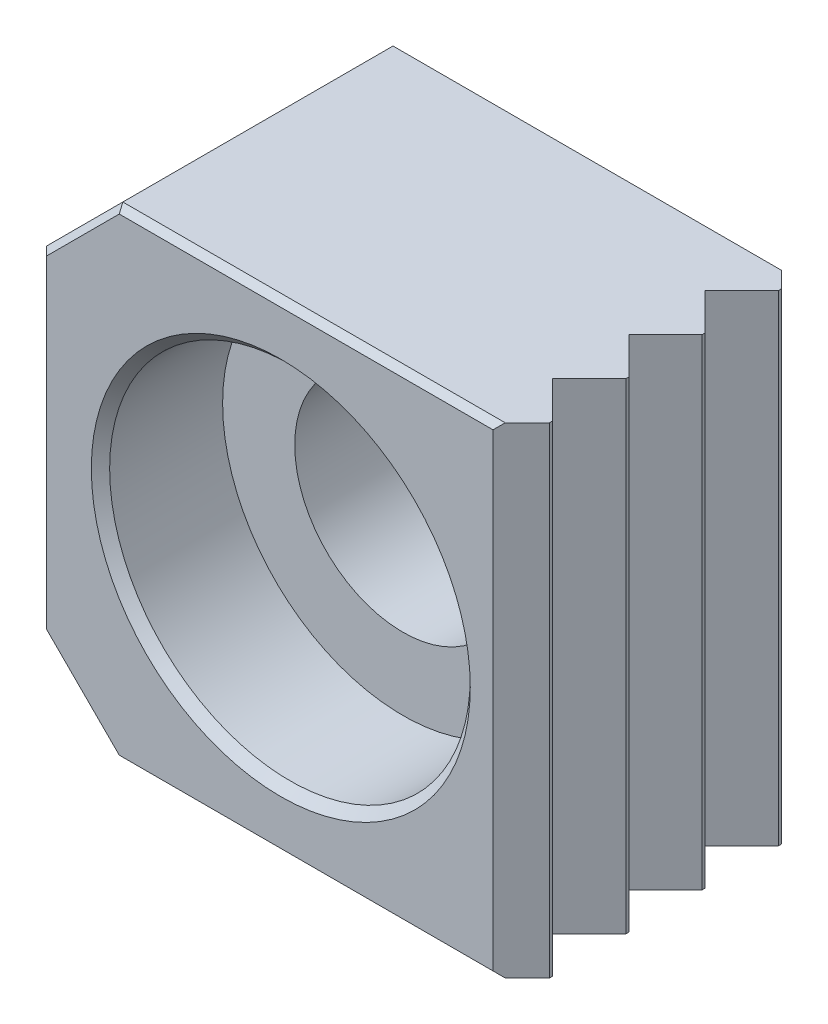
ISO-10303-21;
HEADER;
FILE_DESCRIPTION(('STEP AP214'),'2;1');
FILE_NAME('part.step','',(''),(''),'','','');
FILE_SCHEMA(('AUTOMOTIVE_DESIGN { 1 0 10303 214 1 1 1 1 }'));
ENDSEC;
DATA;
#1=APPLICATION_CONTEXT('core data for automotive mechanical design processes');
#2=APPLICATION_PROTOCOL_DEFINITION('international standard','automotive_design',2000,#1);
#3=PRODUCT_CONTEXT('',#1,'mechanical');
#4=PRODUCT('Part','Part','',(#3));
#5=PRODUCT_RELATED_PRODUCT_CATEGORY('part','',(#4));
#6=PRODUCT_DEFINITION_FORMATION('','',#4);
#7=PRODUCT_DEFINITION_CONTEXT('part definition',#1,'design');
#8=PRODUCT_DEFINITION('design','',#6,#7);
#9=PRODUCT_DEFINITION_SHAPE('','',#8);
#10=(LENGTH_UNIT() NAMED_UNIT(*) SI_UNIT(.MILLI.,.METRE.));
#11=(NAMED_UNIT(*) PLANE_ANGLE_UNIT() SI_UNIT($,.RADIAN.));
#12=(NAMED_UNIT(*) SI_UNIT($,.STERADIAN.) SOLID_ANGLE_UNIT());
#13=UNCERTAINTY_MEASURE_WITH_UNIT(LENGTH_MEASURE(1.E-05),#10,'distance_accuracy_value','');
#14=(GEOMETRIC_REPRESENTATION_CONTEXT(3) GLOBAL_UNCERTAINTY_ASSIGNED_CONTEXT((#13)) GLOBAL_UNIT_ASSIGNED_CONTEXT((#10,
#11,#12)) REPRESENTATION_CONTEXT('',''));
#15=CARTESIAN_POINT('',(0.,0.,0.));
#16=DIRECTION('',(0.,0.,1.));
#17=DIRECTION('',(1.,0.,0.));
#18=AXIS2_PLACEMENT_3D('',#15,#16,#17);
#19=CARTESIAN_POINT('',(10.,-10.,12.));
#20=DIRECTION('',(-1.,0.,0.));
#21=DIRECTION('',(0.,-1.,0.));
#22=AXIS2_PLACEMENT_3D('',#19,#20,#21);
#23=PLANE('',#22);
#24=DIRECTION('',(0.,-1.,0.));
#25=VECTOR('',#24,1.);
#26=CARTESIAN_POINT('',(10.,-10.,7.52399999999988));
#27=LINE('',#26,#25);
#28=CARTESIAN_POINT('',(10.,10.,7.52399999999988));
#29=VERTEX_POINT('',#28);
#30=CARTESIAN_POINT('',(10.,-10.,7.52399999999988));
#31=VERTEX_POINT('',#30);
#32=EDGE_CURVE('E254',#29,#31,#27,.T.);
#33=ORIENTED_EDGE('',*,*,#32,.F.);
#34=DIRECTION('',(0.,0.,-1.));
#35=VECTOR('',#34,1.);
#36=CARTESIAN_POINT('',(10.,10.,12.));
#37=LINE('',#36,#35);
#38=CARTESIAN_POINT('',(10.,10.,7.65099999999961));
#39=VERTEX_POINT('',#38);
#40=EDGE_CURVE('E756',#39,#29,#37,.T.);
#41=ORIENTED_EDGE('',*,*,#40,.F.);
#42=DIRECTION('',(0.,1.,0.));
#43=VECTOR('',#42,1.);
#44=CARTESIAN_POINT('',(10.,-10.,7.65099999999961));
#45=LINE('',#44,#43);
#46=CARTESIAN_POINT('',(10.,-10.,7.65099999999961));
#47=VERTEX_POINT('',#46);
#48=EDGE_CURVE('E252',#47,#39,#45,.T.);
#49=ORIENTED_EDGE('',*,*,#48,.F.);
#50=DIRECTION('',(0.,0.,-1.));
#51=VECTOR('',#50,1.);
#52=CARTESIAN_POINT('',(10.,-10.,12.));
#53=LINE('',#52,#51);
#54=EDGE_CURVE('E196',#47,#31,#53,.T.);
#55=ORIENTED_EDGE('',*,*,#54,.T.);
#56=EDGE_LOOP('',(#33,#41,#49,#55));
#57=FACE_BOUND('',#56,.T.);
#58=ADVANCED_FACE('F14',(#57),#23,.F.);
#59=DIRECTION('',(0.,-1.,0.));
#60=VECTOR('',#59,1.);
#61=CARTESIAN_POINT('',(10.,-10.,10.6989999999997));
#62=LINE('',#61,#60);
#63=CARTESIAN_POINT('',(10.,10.,10.6989999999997));
#64=VERTEX_POINT('',#63);
#65=CARTESIAN_POINT('',(10.,-10.,10.6989999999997));
#66=VERTEX_POINT('',#65);
#67=EDGE_CURVE('E185',#64,#66,#62,.T.);
#68=ORIENTED_EDGE('',*,*,#67,.F.);
#69=CARTESIAN_POINT('',(10.,10.,10.8259999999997));
#70=VERTEX_POINT('',#69);
#71=EDGE_CURVE('E271',#70,#64,#37,.T.);
#72=ORIENTED_EDGE('',*,*,#71,.F.);
#73=DIRECTION('',(0.,1.,0.));
#74=VECTOR('',#73,1.);
#75=CARTESIAN_POINT('',(10.,-10.,10.8259999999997));
#76=LINE('',#75,#74);
#77=CARTESIAN_POINT('',(10.,-10.,10.8259999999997));
#78=VERTEX_POINT('',#77);
#79=EDGE_CURVE('E240',#78,#70,#76,.T.);
#80=ORIENTED_EDGE('',*,*,#79,.F.);
#81=EDGE_CURVE('E266',#78,#66,#53,.T.);
#82=ORIENTED_EDGE('',*,*,#81,.T.);
#83=EDGE_LOOP('',(#68,#72,#80,#82));
#84=FACE_BOUND('',#83,.T.);
#85=ADVANCED_FACE('F422',(#84),#23,.F.);
#86=CARTESIAN_POINT('',(10.,-10.,1.30100000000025));
#87=VERTEX_POINT('',#86);
#88=CARTESIAN_POINT('',(10.,-10.,1.17400000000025));
#89=VERTEX_POINT('',#88);
#90=EDGE_CURVE('E262',#87,#89,#53,.T.);
#91=ORIENTED_EDGE('',*,*,#90,.T.);
#92=DIRECTION('',(0.,1.,0.));
#93=VECTOR('',#92,1.);
#94=CARTESIAN_POINT('',(10.,-10.,1.17400000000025));
#95=LINE('',#94,#93);
#96=CARTESIAN_POINT('',(10.,10.,1.17400000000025));
#97=VERTEX_POINT('',#96);
#98=EDGE_CURVE('E178',#89,#97,#95,.T.);
#99=ORIENTED_EDGE('',*,*,#98,.T.);
#100=CARTESIAN_POINT('',(10.,10.,1.30100000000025));
#101=VERTEX_POINT('',#100);
#102=EDGE_CURVE('E267',#101,#97,#37,.T.);
#103=ORIENTED_EDGE('',*,*,#102,.F.);
#104=DIRECTION('',(0.,-1.,0.));
#105=VECTOR('',#104,1.);
#106=CARTESIAN_POINT('',(10.,-10.,1.30100000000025));
#107=LINE('',#106,#105);
#108=EDGE_CURVE('E248',#101,#87,#107,.T.);
#109=ORIENTED_EDGE('',*,*,#108,.T.);
#110=EDGE_LOOP('',(#91,#99,#103,#109));
#111=FACE_BOUND('',#110,.T.);
#112=ADVANCED_FACE('F427',(#111),#23,.F.);
#113=CARTESIAN_POINT('',(-10.,10.,12.));
#114=DIRECTION('',(0.,1.,0.));
#115=DIRECTION('',(-1.,0.,0.));
#116=AXIS2_PLACEMENT_3D('',#113,#114,#115);
#117=PLANE('',#116);
#118=DIRECTION('',(0.,0.,1.));
#119=VECTOR('',#118,1.);
#120=CARTESIAN_POINT('',(-6.825,10.,12.));
#121=LINE('',#120,#119);
#122=CARTESIAN_POINT('',(-6.825,10.,0.508));
#123=VERTEX_POINT('',#122);
#124=CARTESIAN_POINT('',(-6.825,10.,11.746));
#125=VERTEX_POINT('',#124);
#126=EDGE_CURVE('E284',#123,#125,#121,.T.);
#127=ORIENTED_EDGE('',*,*,#126,.T.);
#128=DIRECTION('',(1.,0.,0.));
#129=VECTOR('',#128,1.);
#130=CARTESIAN_POINT('',(8.826,10.,11.746));
#131=LINE('',#130,#129);
#132=CARTESIAN_POINT('',(9.08,10.,11.746));
#133=VERTEX_POINT('',#132);
#134=EDGE_CURVE('E9',#125,#133,#131,.T.);
#135=ORIENTED_EDGE('',*,*,#134,.T.);
#136=DIRECTION('',(-0.707106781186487,0.,0.707106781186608));
#137=VECTOR('',#136,1.);
#138=CARTESIAN_POINT('',(10.0635,10.,10.7624999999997));
#139=LINE('',#138,#137);
#140=EDGE_CURVE('E218',#70,#133,#139,.T.);
#141=ORIENTED_EDGE('',*,*,#140,.F.);
#142=ORIENTED_EDGE('',*,*,#71,.T.);
#143=DIRECTION('',(0.707106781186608,0.,0.707106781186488));
#144=VECTOR('',#143,1.);
#145=CARTESIAN_POINT('',(8.476,10.,9.175));
#146=LINE('',#145,#144);
#147=CARTESIAN_POINT('',(8.476,10.,9.175));
#148=VERTEX_POINT('',#147);
#149=EDGE_CURVE('E216',#148,#64,#146,.T.);
#150=ORIENTED_EDGE('',*,*,#149,.F.);
#151=DIRECTION('',(-0.707106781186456,0.,0.707106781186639));
#152=VECTOR('',#151,1.);
#153=CARTESIAN_POINT('',(10.0634999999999,10.,7.58749999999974));
#154=LINE('',#153,#152);
#155=EDGE_CURVE('E175',#39,#148,#154,.T.);
#156=ORIENTED_EDGE('',*,*,#155,.F.);
#157=ORIENTED_EDGE('',*,*,#40,.T.);
#158=DIRECTION('',(0.707106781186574,0.,0.707106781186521));
#159=VECTOR('',#158,1.);
#160=CARTESIAN_POINT('',(8.476,10.,6.));
#161=LINE('',#160,#159);
#162=CARTESIAN_POINT('',(8.476,10.,6.));
#163=VERTEX_POINT('',#162);
#164=EDGE_CURVE('E213',#163,#29,#161,.T.);
#165=ORIENTED_EDGE('',*,*,#164,.F.);
#166=DIRECTION('',(0.707106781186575,0.,-0.70710678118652));
#167=VECTOR('',#166,1.);
#168=CARTESIAN_POINT('',(8.476,10.,6.));
#169=LINE('',#168,#167);
#170=CARTESIAN_POINT('',(10.,10.,4.47600000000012));
#171=VERTEX_POINT('',#170);
#172=EDGE_CURVE('E230',#163,#171,#169,.T.);
#173=ORIENTED_EDGE('',*,*,#172,.T.);
#174=CARTESIAN_POINT('',(10.,10.,4.34900000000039));
#175=VERTEX_POINT('',#174);
#176=EDGE_CURVE('E270',#171,#175,#37,.T.);
#177=ORIENTED_EDGE('',*,*,#176,.T.);
#178=DIRECTION('',(-0.707106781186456,0.,-0.707106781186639));
#179=VECTOR('',#178,1.);
#180=CARTESIAN_POINT('',(10.0634999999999,10.,4.41250000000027));
#181=LINE('',#180,#179);
#182=CARTESIAN_POINT('',(8.476,10.,2.825));
#183=VERTEX_POINT('',#182);
#184=EDGE_CURVE('E227',#175,#183,#181,.T.);
#185=ORIENTED_EDGE('',*,*,#184,.T.);
#186=DIRECTION('',(0.707106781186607,0.,-0.707106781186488));
#187=VECTOR('',#186,1.);
#188=CARTESIAN_POINT('',(8.476,10.,2.825));
#189=LINE('',#188,#187);
#190=EDGE_CURVE('E224',#183,#101,#189,.T.);
#191=ORIENTED_EDGE('',*,*,#190,.T.);
#192=ORIENTED_EDGE('',*,*,#102,.T.);
#193=DIRECTION('',(-0.707106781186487,0.,-0.707106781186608));
#194=VECTOR('',#193,1.);
#195=CARTESIAN_POINT('',(10.0635,10.,1.23750000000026));
#196=LINE('',#195,#194);
#197=CARTESIAN_POINT('',(9.33399999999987,10.,0.508));
#198=VERTEX_POINT('',#197);
#199=EDGE_CURVE('E221',#97,#198,#196,.T.);
#200=ORIENTED_EDGE('',*,*,#199,.T.);
#201=DIRECTION('',(-1.,0.,0.));
#202=VECTOR('',#201,1.);
#203=CARTESIAN_POINT('',(-10.,10.,0.508));
#204=LINE('',#203,#202);
#205=EDGE_CURVE('E323',#198,#123,#204,.T.);
#206=ORIENTED_EDGE('',*,*,#205,.T.);
#207=EDGE_LOOP('',(#127,#135,#141,#142,#150,#156,#157,#165,#173,#177,#185,#191,#192,#200,#206));
#208=FACE_BOUND('',#207,.T.);
#209=ADVANCED_FACE('F442',(#208),#117,.T.);
#210=CARTESIAN_POINT('',(10.,-10.,12.));
#211=DIRECTION('',(0.,-1.,0.));
#212=DIRECTION('',(1.,0.,0.));
#213=AXIS2_PLACEMENT_3D('',#210,#211,#212);
#214=PLANE('',#213);
#215=DIRECTION('',(-0.707106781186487,0.,0.707106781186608));
#216=VECTOR('',#215,1.);
#217=CARTESIAN_POINT('',(10.0635,-10.,10.7624999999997));
#218=LINE('',#217,#216);
#219=CARTESIAN_POINT('',(9.08,-10.,11.746));
#220=VERTEX_POINT('',#219);
#221=EDGE_CURVE('E189',#78,#220,#218,.T.);
#222=ORIENTED_EDGE('',*,*,#221,.T.);
#223=DIRECTION('',(-1.,0.,0.));
#224=VECTOR('',#223,1.);
#225=CARTESIAN_POINT('',(-6.825,-10.,11.746));
#226=LINE('',#225,#224);
#227=CARTESIAN_POINT('',(-6.825,-10.,11.746));
#228=VERTEX_POINT('',#227);
#229=EDGE_CURVE('E325',#220,#228,#226,.T.);
#230=ORIENTED_EDGE('',*,*,#229,.T.);
#231=DIRECTION('',(0.,0.,-1.));
#232=VECTOR('',#231,1.);
#233=CARTESIAN_POINT('',(-6.825,-10.,0.));
#234=LINE('',#233,#232);
#235=CARTESIAN_POINT('',(-6.825,-10.,0.508));
#236=VERTEX_POINT('',#235);
#237=EDGE_CURVE('E278',#228,#236,#234,.T.);
#238=ORIENTED_EDGE('',*,*,#237,.T.);
#239=DIRECTION('',(1.,0.,0.));
#240=VECTOR('',#239,1.);
#241=CARTESIAN_POINT('',(10.,-10.,0.508));
#242=LINE('',#241,#240);
#243=CARTESIAN_POINT('',(9.33399999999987,-10.,0.508));
#244=VERTEX_POINT('',#243);
#245=EDGE_CURVE('E309',#236,#244,#242,.T.);
#246=ORIENTED_EDGE('',*,*,#245,.T.);
#247=DIRECTION('',(-0.707106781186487,0.,-0.707106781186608));
#248=VECTOR('',#247,1.);
#249=CARTESIAN_POINT('',(10.0635,-10.,1.23750000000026));
#250=LINE('',#249,#248);
#251=EDGE_CURVE('E204',#89,#244,#250,.T.);
#252=ORIENTED_EDGE('',*,*,#251,.F.);
#253=ORIENTED_EDGE('',*,*,#90,.F.);
#254=DIRECTION('',(0.707106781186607,0.,-0.707106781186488));
#255=VECTOR('',#254,1.);
#256=CARTESIAN_POINT('',(8.476,-10.,2.825));
#257=LINE('',#256,#255);
#258=CARTESIAN_POINT('',(8.476,-10.,2.825));
#259=VERTEX_POINT('',#258);
#260=EDGE_CURVE('E207',#259,#87,#257,.T.);
#261=ORIENTED_EDGE('',*,*,#260,.F.);
#262=DIRECTION('',(-0.707106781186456,0.,-0.707106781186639));
#263=VECTOR('',#262,1.);
#264=CARTESIAN_POINT('',(10.0634999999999,-10.,4.41250000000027));
#265=LINE('',#264,#263);
#266=CARTESIAN_POINT('',(10.,-10.,4.34900000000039));
#267=VERTEX_POINT('',#266);
#268=EDGE_CURVE('E209',#267,#259,#265,.T.);
#269=ORIENTED_EDGE('',*,*,#268,.F.);
#270=CARTESIAN_POINT('',(10.,-10.,4.47600000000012));
#271=VERTEX_POINT('',#270);
#272=EDGE_CURVE('E265',#271,#267,#53,.T.);
#273=ORIENTED_EDGE('',*,*,#272,.F.);
#274=DIRECTION('',(0.707106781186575,0.,-0.70710678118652));
#275=VECTOR('',#274,1.);
#276=CARTESIAN_POINT('',(8.476,-10.,6.));
#277=LINE('',#276,#275);
#278=CARTESIAN_POINT('',(8.476,-10.,6.));
#279=VERTEX_POINT('',#278);
#280=EDGE_CURVE('E211',#279,#271,#277,.T.);
#281=ORIENTED_EDGE('',*,*,#280,.F.);
#282=DIRECTION('',(0.707106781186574,0.,0.707106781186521));
#283=VECTOR('',#282,1.);
#284=CARTESIAN_POINT('',(8.476,-10.,6.));
#285=LINE('',#284,#283);
#286=EDGE_CURVE('E197',#279,#31,#285,.T.);
#287=ORIENTED_EDGE('',*,*,#286,.T.);
#288=ORIENTED_EDGE('',*,*,#54,.F.);
#289=DIRECTION('',(-0.707106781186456,0.,0.707106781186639));
#290=VECTOR('',#289,1.);
#291=CARTESIAN_POINT('',(10.0634999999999,-10.,7.58749999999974));
#292=LINE('',#291,#290);
#293=CARTESIAN_POINT('',(8.476,-10.,9.175));
#294=VERTEX_POINT('',#293);
#295=EDGE_CURVE('E172',#47,#294,#292,.T.);
#296=ORIENTED_EDGE('',*,*,#295,.T.);
#297=DIRECTION('',(0.707106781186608,0.,0.707106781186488));
#298=VECTOR('',#297,1.);
#299=CARTESIAN_POINT('',(8.476,-10.,9.175));
#300=LINE('',#299,#298);
#301=EDGE_CURVE('E182',#294,#66,#300,.T.);
#302=ORIENTED_EDGE('',*,*,#301,.T.);
#303=ORIENTED_EDGE('',*,*,#81,.F.);
#304=EDGE_LOOP('',(#222,#230,#238,#246,#252,#253,#261,#269,#273,#281,#287,#288,#296,#302,#303));
#305=FACE_BOUND('',#304,.T.);
#306=ADVANCED_FACE('F193',(#305),#214,.T.);
#307=CARTESIAN_POINT('',(10.,10.,12.));
#308=DIRECTION('',(0.,0.,-1.));
#309=DIRECTION('',(1.,0.,0.));
#310=AXIS2_PLACEMENT_3D('',#307,#308,#309);
#311=PLANE('',#310);
#312=CARTESIAN_POINT('',(0.,0.,12.));
#313=DIRECTION('',(0.,0.,-1.));
#314=DIRECTION('',(1.,0.,0.));
#315=AXIS2_PLACEMENT_3D('',#312,#313,#314);
#316=CIRCLE('',#315,7.881);
#317=CARTESIAN_POINT('',(7.881,0.,12.));
#318=VERTEX_POINT('',#317);
#319=EDGE_CURVE('E289',#318,#318,#316,.T.);
#320=ORIENTED_EDGE('',*,*,#319,.T.);
#321=EDGE_LOOP('',(#320));
#322=FACE_BOUND('',#321,.T.);
#323=DIRECTION('',(0.707106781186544,-0.707106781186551,0.));
#324=VECTOR('',#323,1.);
#325=CARTESIAN_POINT('',(-6.64539487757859,-9.82039487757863,12.));
#326=LINE('',#325,#324);
#327=CARTESIAN_POINT('',(-9.746,-6.71978975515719,12.));
#328=VERTEX_POINT('',#327);
#329=CARTESIAN_POINT('',(-6.71978975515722,-9.746,12.));
#330=VERTEX_POINT('',#329);
#331=EDGE_CURVE('E334',#328,#330,#326,.T.);
#332=ORIENTED_EDGE('',*,*,#331,.T.);
#333=DIRECTION('',(1.,0.,0.));
#334=VECTOR('',#333,1.);
#335=CARTESIAN_POINT('',(8.826,-9.746,12.));
#336=LINE('',#335,#334);
#337=CARTESIAN_POINT('',(8.826,-9.746,12.));
#338=VERTEX_POINT('',#337);
#339=EDGE_CURVE('E336',#330,#338,#336,.T.);
#340=ORIENTED_EDGE('',*,*,#339,.T.);
#341=DIRECTION('',(0.,-1.,0.));
#342=VECTOR('',#341,1.);
#343=CARTESIAN_POINT('',(8.826,10.,12.));
#344=LINE('',#343,#342);
#345=CARTESIAN_POINT('',(8.826,9.746,12.));
#346=VERTEX_POINT('',#345);
#347=EDGE_CURVE('E275',#346,#338,#344,.T.);
#348=ORIENTED_EDGE('',*,*,#347,.F.);
#349=DIRECTION('',(-1.,0.,0.));
#350=VECTOR('',#349,1.);
#351=CARTESIAN_POINT('',(-6.825,9.746,12.));
#352=LINE('',#351,#350);
#353=CARTESIAN_POINT('',(-6.71978975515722,9.746,12.));
#354=VERTEX_POINT('',#353);
#355=EDGE_CURVE('E328',#346,#354,#352,.T.);
#356=ORIENTED_EDGE('',*,*,#355,.T.);
#357=DIRECTION('',(-0.707106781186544,-0.707106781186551,0.));
#358=VECTOR('',#357,1.);
#359=CARTESIAN_POINT('',(-9.82039487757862,6.64539487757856,12.));
#360=LINE('',#359,#358);
#361=CARTESIAN_POINT('',(-9.746,6.71978975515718,12.));
#362=VERTEX_POINT('',#361);
#363=EDGE_CURVE('E330',#354,#362,#360,.T.);
#364=ORIENTED_EDGE('',*,*,#363,.T.);
#365=DIRECTION('',(0.,-1.,0.));
#366=VECTOR('',#365,1.);
#367=CARTESIAN_POINT('',(-9.746,10.,12.));
#368=LINE('',#367,#366);
#369=EDGE_CURVE('E332',#362,#328,#368,.T.);
#370=ORIENTED_EDGE('',*,*,#369,.T.);
#371=EDGE_LOOP('',(#332,#340,#348,#356,#364,#370));
#372=FACE_BOUND('',#371,.T.);
#373=ADVANCED_FACE('F431',(#322,#372),#311,.F.);
#374=ORIENTED_EDGE('',*,*,#272,.T.);
#375=DIRECTION('',(0.,1.,0.));
#376=VECTOR('',#375,1.);
#377=CARTESIAN_POINT('',(10.,-10.,4.34900000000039));
#378=LINE('',#377,#376);
#379=EDGE_CURVE('E245',#267,#175,#378,.T.);
#380=ORIENTED_EDGE('',*,*,#379,.T.);
#381=ORIENTED_EDGE('',*,*,#176,.F.);
#382=DIRECTION('',(0.,-1.,0.));
#383=VECTOR('',#382,1.);
#384=CARTESIAN_POINT('',(10.,-10.,4.47600000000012));
#385=LINE('',#384,#383);
#386=EDGE_CURVE('E242',#171,#271,#385,.T.);
#387=ORIENTED_EDGE('',*,*,#386,.T.);
#388=EDGE_LOOP('',(#374,#380,#381,#387));
#389=FACE_BOUND('',#388,.T.);
#390=ADVANCED_FACE('F16',(#389),#23,.F.);
#391=CARTESIAN_POINT('',(-10.,10.,12.));
#392=DIRECTION('',(1.,0.,0.));
#393=DIRECTION('',(0.,0.,1.));
#394=AXIS2_PLACEMENT_3D('',#391,#392,#393);
#395=PLANE('',#394);
#396=DIRECTION('',(0.,0.,1.));
#397=VECTOR('',#396,1.);
#398=CARTESIAN_POINT('',(-10.,-6.825,12.));
#399=LINE('',#398,#397);
#400=CARTESIAN_POINT('',(-10.,-6.825,0.508));
#401=VERTEX_POINT('',#400);
#402=CARTESIAN_POINT('',(-10.,-6.825,11.746));
#403=VERTEX_POINT('',#402);
#404=EDGE_CURVE('E282',#401,#403,#399,.T.);
#405=ORIENTED_EDGE('',*,*,#404,.T.);
#406=DIRECTION('',(0.,1.,0.));
#407=VECTOR('',#406,1.);
#408=CARTESIAN_POINT('',(-10.,10.,11.746));
#409=LINE('',#408,#407);
#410=CARTESIAN_POINT('',(-10.,6.825,11.746));
#411=VERTEX_POINT('',#410);
#412=EDGE_CURVE('E36',#403,#411,#409,.T.);
#413=ORIENTED_EDGE('',*,*,#412,.T.);
#414=DIRECTION('',(0.,0.,-1.));
#415=VECTOR('',#414,1.);
#416=CARTESIAN_POINT('',(-10.,6.825,0.));
#417=LINE('',#416,#415);
#418=CARTESIAN_POINT('',(-10.,6.825,0.508));
#419=VERTEX_POINT('',#418);
#420=EDGE_CURVE('E280',#411,#419,#417,.T.);
#421=ORIENTED_EDGE('',*,*,#420,.T.);
#422=DIRECTION('',(0.,-1.,0.));
#423=VECTOR('',#422,1.);
#424=CARTESIAN_POINT('',(-10.,-6.825,0.508));
#425=LINE('',#424,#423);
#426=EDGE_CURVE('E318',#419,#401,#425,.T.);
#427=ORIENTED_EDGE('',*,*,#426,.T.);
#428=EDGE_LOOP('',(#405,#413,#421,#427));
#429=FACE_BOUND('',#428,.T.);
#430=ADVANCED_FACE('F353',(#429),#395,.F.);
#431=CARTESIAN_POINT('',(10.,10.,0.));
#432=DIRECTION('',(0.,0.,-1.));
#433=DIRECTION('',(1.,0.,0.));
#434=AXIS2_PLACEMENT_3D('',#431,#432,#433);
#435=PLANE('',#434);
#436=CARTESIAN_POINT('',(0.,0.,0.));
#437=DIRECTION('',(0.,0.,-1.));
#438=DIRECTION('',(1.,0.,0.));
#439=AXIS2_PLACEMENT_3D('',#436,#437,#438);
#440=CIRCLE('',#439,4.881);
#441=CARTESIAN_POINT('',(4.881,0.,0.));
#442=VERTEX_POINT('',#441);
#443=EDGE_CURVE('E292',#442,#442,#440,.F.);
#444=ORIENTED_EDGE('',*,*,#443,.T.);
#445=EDGE_LOOP('',(#444));
#446=FACE_BOUND('',#445,.T.);
#447=DIRECTION('',(0.,1.,0.));
#448=VECTOR('',#447,1.);
#449=CARTESIAN_POINT('',(8.826,10.,0.));
#450=LINE('',#449,#448);
#451=CARTESIAN_POINT('',(8.826,-9.492,0.));
#452=VERTEX_POINT('',#451);
#453=CARTESIAN_POINT('',(8.826,9.492,0.));
#454=VERTEX_POINT('',#453);
#455=EDGE_CURVE('E272',#452,#454,#450,.T.);
#456=ORIENTED_EDGE('',*,*,#455,.F.);
#457=DIRECTION('',(-1.,0.,0.));
#458=VECTOR('',#457,1.);
#459=CARTESIAN_POINT('',(10.,-9.492,0.));
#460=LINE('',#459,#458);
#461=CARTESIAN_POINT('',(-6.61457951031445,-9.492,0.));
#462=VERTEX_POINT('',#461);
#463=EDGE_CURVE('E306',#452,#462,#460,.T.);
#464=ORIENTED_EDGE('',*,*,#463,.T.);
#465=DIRECTION('',(-0.707106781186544,0.707106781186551,0.));
#466=VECTOR('',#465,1.);
#467=CARTESIAN_POINT('',(-8.05328975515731,-8.05328975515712,0.));
#468=LINE('',#467,#466);
#469=CARTESIAN_POINT('',(-9.492,-6.61457951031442,0.));
#470=VERTEX_POINT('',#469);
#471=EDGE_CURVE('E304',#462,#470,#468,.T.);
#472=ORIENTED_EDGE('',*,*,#471,.T.);
#473=DIRECTION('',(0.,1.,0.));
#474=VECTOR('',#473,1.);
#475=CARTESIAN_POINT('',(-9.492,6.825,0.));
#476=LINE('',#475,#474);
#477=CARTESIAN_POINT('',(-9.492,6.61457951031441,0.));
#478=VERTEX_POINT('',#477);
#479=EDGE_CURVE('E302',#470,#478,#476,.T.);
#480=ORIENTED_EDGE('',*,*,#479,.T.);
#481=DIRECTION('',(0.707106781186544,0.707106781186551,0.));
#482=VECTOR('',#481,1.);
#483=CARTESIAN_POINT('',(1.9467102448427,18.0532897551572,0.));
#484=LINE('',#483,#482);
#485=CARTESIAN_POINT('',(-6.61457951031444,9.492,0.));
#486=VERTEX_POINT('',#485);
#487=EDGE_CURVE('E300',#478,#486,#484,.T.);
#488=ORIENTED_EDGE('',*,*,#487,.T.);
#489=DIRECTION('',(1.,0.,0.));
#490=VECTOR('',#489,1.);
#491=CARTESIAN_POINT('',(10.,9.492,0.));
#492=LINE('',#491,#490);
#493=EDGE_CURVE('E298',#486,#454,#492,.T.);
#494=ORIENTED_EDGE('',*,*,#493,.T.);
#495=EDGE_LOOP('',(#456,#464,#472,#480,#488,#494));
#496=FACE_BOUND('',#495,.T.);
#497=ADVANCED_FACE('F394',(#446,#496),#435,.T.);
#498=CARTESIAN_POINT('',(0.,0.,6.92));
#499=DIRECTION('',(0.,0.,1.));
#500=DIRECTION('',(-1.,0.,0.));
#501=AXIS2_PLACEMENT_3D('',#498,#499,#500);
#502=CYLINDRICAL_SURFACE('',#501,7.5);
#503=CARTESIAN_POINT('',(0.,0.,11.619));
#504=DIRECTION('',(0.,0.,-1.));
#505=DIRECTION('',(1.,0.,0.));
#506=AXIS2_PLACEMENT_3D('',#503,#504,#505);
#507=CIRCLE('',#506,7.5);
#508=CARTESIAN_POINT('',(7.5,0.,11.619));
#509=VERTEX_POINT('',#508);
#510=EDGE_CURVE('E286',#509,#509,#507,.F.);
#511=ORIENTED_EDGE('',*,*,#510,.T.);
#512=EDGE_LOOP('',(#511));
#513=FACE_BOUND('',#512,.T.);
#514=CARTESIAN_POINT('',(0.,0.,6.92));
#515=DIRECTION('',(0.,0.,1.));
#516=DIRECTION('',(-1.,0.,0.));
#517=AXIS2_PLACEMENT_3D('',#514,#515,#516);
#518=CIRCLE('',#517,7.5);
#519=CARTESIAN_POINT('',(-7.5,0.,6.92));
#520=VERTEX_POINT('',#519);
#521=EDGE_CURVE('E259',#520,#520,#518,.T.);
#522=ORIENTED_EDGE('',*,*,#521,.F.);
#523=EDGE_LOOP('',(#522));
#524=FACE_BOUND('',#523,.T.);
#525=ADVANCED_FACE('F673',(#513,#524),#502,.F.);
#526=CARTESIAN_POINT('',(0.,0.,6.92));
#527=DIRECTION('',(0.,0.,1.));
#528=DIRECTION('',(-1.,0.,0.));
#529=AXIS2_PLACEMENT_3D('',#526,#527,#528);
#530=PLANE('',#529);
#531=CARTESIAN_POINT('',(0.,0.,6.92));
#532=DIRECTION('',(0.,0.,1.));
#533=DIRECTION('',(-1.,0.,0.));
#534=AXIS2_PLACEMENT_3D('',#531,#532,#533);
#535=CIRCLE('',#534,4.5);
#536=CARTESIAN_POINT('',(-4.5,0.,6.92));
#537=VERTEX_POINT('',#536);
#538=EDGE_CURVE('E256',#537,#537,#535,.T.);
#539=ORIENTED_EDGE('',*,*,#538,.F.);
#540=EDGE_LOOP('',(#539));
#541=FACE_BOUND('',#540,.T.);
#542=ORIENTED_EDGE('',*,*,#521,.T.);
#543=EDGE_LOOP('',(#542));
#544=FACE_BOUND('',#543,.T.);
#545=ADVANCED_FACE('F663',(#541,#544),#530,.T.);
#546=CARTESIAN_POINT('',(0.,0.,0.));
#547=DIRECTION('',(0.,0.,1.));
#548=DIRECTION('',(-1.,0.,0.));
#549=AXIS2_PLACEMENT_3D('',#546,#547,#548);
#550=CYLINDRICAL_SURFACE('',#549,4.5);
#551=CARTESIAN_POINT('',(0.,0.,0.381));
#552=DIRECTION('',(0.,0.,-1.));
#553=DIRECTION('',(1.,0.,0.));
#554=AXIS2_PLACEMENT_3D('',#551,#552,#553);
#555=CIRCLE('',#554,4.5);
#556=CARTESIAN_POINT('',(4.5,0.,0.381));
#557=VERTEX_POINT('',#556);
#558=EDGE_CURVE('E295',#557,#557,#555,.T.);
#559=ORIENTED_EDGE('',*,*,#558,.T.);
#560=EDGE_LOOP('',(#559));
#561=FACE_BOUND('',#560,.T.);
#562=ORIENTED_EDGE('',*,*,#538,.T.);
#563=EDGE_LOOP('',(#562));
#564=FACE_BOUND('',#563,.T.);
#565=ADVANCED_FACE('F654',(#561,#564),#550,.F.);
#566=CARTESIAN_POINT('',(10.0635,10.,1.23750000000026));
#567=DIRECTION('',(-0.707106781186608,0.,0.707106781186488));
#568=DIRECTION('',(-0.707106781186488,0.,-0.707106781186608));
#569=AXIS2_PLACEMENT_3D('',#566,#567,#568);
#570=PLANE('',#569);
#571=ORIENTED_EDGE('',*,*,#251,.T.);
#572=DIRECTION('',(0.577350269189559,-0.577350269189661,0.577350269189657));
#573=VECTOR('',#572,1.);
#574=CARTESIAN_POINT('',(9.21733333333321,-9.88333333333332,0.391333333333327));
#575=LINE('',#574,#573);
#576=EDGE_CURVE('E313',#244,#452,#575,.F.);
#577=ORIENTED_EDGE('',*,*,#576,.T.);
#578=ORIENTED_EDGE('',*,*,#455,.T.);
#579=DIRECTION('',(-0.577350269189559,-0.577350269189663,-0.577350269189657));
#580=VECTOR('',#579,1.);
#581=CARTESIAN_POINT('',(9.21733333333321,9.88333333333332,0.391333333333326));
#582=LINE('',#581,#580);
#583=EDGE_CURVE('E311',#454,#198,#582,.F.);
#584=ORIENTED_EDGE('',*,*,#583,.T.);
#585=ORIENTED_EDGE('',*,*,#199,.F.);
#586=ORIENTED_EDGE('',*,*,#98,.F.);
#587=EDGE_LOOP('',(#571,#577,#578,#584,#585,#586));
#588=FACE_BOUND('',#587,.T.);
#589=ADVANCED_FACE('F397',(#588),#570,.F.);
#590=CARTESIAN_POINT('',(10.0635,10.,10.7624999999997));
#591=DIRECTION('',(0.707106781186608,0.,0.707106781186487));
#592=DIRECTION('',(-0.707106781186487,0.,0.707106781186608));
#593=AXIS2_PLACEMENT_3D('',#590,#591,#592);
#594=PLANE('',#593);
#595=ORIENTED_EDGE('',*,*,#347,.T.);
#596=DIRECTION('',(0.577350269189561,-0.577350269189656,-0.57735026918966));
#597=VECTOR('',#596,1.);
#598=CARTESIAN_POINT('',(3.06900000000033,-3.98899999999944,17.7570000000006));
#599=LINE('',#598,#597);
#600=EDGE_CURVE('E340',#338,#220,#599,.T.);
#601=ORIENTED_EDGE('',*,*,#600,.T.);
#602=ORIENTED_EDGE('',*,*,#221,.F.);
#603=ORIENTED_EDGE('',*,*,#79,.T.);
#604=ORIENTED_EDGE('',*,*,#140,.T.);
#605=DIRECTION('',(-0.577350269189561,-0.577350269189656,0.57735026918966));
#606=VECTOR('',#605,1.);
#607=CARTESIAN_POINT('',(9.7356666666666,10.6556666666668,11.0903333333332));
#608=LINE('',#607,#606);
#609=EDGE_CURVE('E338',#133,#346,#608,.T.);
#610=ORIENTED_EDGE('',*,*,#609,.T.);
#611=EDGE_LOOP('',(#595,#601,#602,#603,#604,#610));
#612=FACE_BOUND('',#611,.T.);
#613=ADVANCED_FACE('F461',(#612),#594,.T.);
#614=CARTESIAN_POINT('',(8.476,10.,6.));
#615=DIRECTION('',(-0.707106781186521,0.,-0.707106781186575));
#616=DIRECTION('',(0.707106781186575,0.,-0.707106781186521));
#617=AXIS2_PLACEMENT_3D('',#614,#615,#616);
#618=PLANE('',#617);
#619=ORIENTED_EDGE('',*,*,#172,.F.);
#620=DIRECTION('',(0.,-1.,0.));
#621=VECTOR('',#620,1.);
#622=CARTESIAN_POINT('',(8.476,10.,6.));
#623=LINE('',#622,#621);
#624=EDGE_CURVE('E233',#163,#279,#623,.T.);
#625=ORIENTED_EDGE('',*,*,#624,.T.);
#626=ORIENTED_EDGE('',*,*,#280,.T.);
#627=ORIENTED_EDGE('',*,*,#386,.F.);
#628=EDGE_LOOP('',(#619,#625,#626,#627));
#629=FACE_BOUND('',#628,.T.);
#630=ADVANCED_FACE('F627',(#629),#618,.F.);
#631=CARTESIAN_POINT('',(8.476,10.,6.));
#632=DIRECTION('',(0.707106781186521,0.,-0.707106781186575));
#633=DIRECTION('',(0.707106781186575,0.,0.707106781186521));
#634=AXIS2_PLACEMENT_3D('',#631,#632,#633);
#635=PLANE('',#634);
#636=ORIENTED_EDGE('',*,*,#32,.T.);
#637=ORIENTED_EDGE('',*,*,#286,.F.);
#638=ORIENTED_EDGE('',*,*,#624,.F.);
#639=ORIENTED_EDGE('',*,*,#164,.T.);
#640=EDGE_LOOP('',(#636,#637,#638,#639));
#641=FACE_BOUND('',#640,.T.);
#642=ADVANCED_FACE('F617',(#641),#635,.T.);
#643=CARTESIAN_POINT('',(10.0634999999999,10.,4.41250000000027));
#644=DIRECTION('',(-0.707106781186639,0.,0.707106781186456));
#645=DIRECTION('',(-0.707106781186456,0.,-0.707106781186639));
#646=AXIS2_PLACEMENT_3D('',#643,#644,#645);
#647=PLANE('',#646);
#648=ORIENTED_EDGE('',*,*,#268,.T.);
#649=DIRECTION('',(0.,-1.,0.));
#650=VECTOR('',#649,1.);
#651=CARTESIAN_POINT('',(8.476,10.,2.825));
#652=LINE('',#651,#650);
#653=EDGE_CURVE('E179',#183,#259,#652,.T.);
#654=ORIENTED_EDGE('',*,*,#653,.F.);
#655=ORIENTED_EDGE('',*,*,#184,.F.);
#656=ORIENTED_EDGE('',*,*,#379,.F.);
#657=EDGE_LOOP('',(#648,#654,#655,#656));
#658=FACE_BOUND('',#657,.T.);
#659=ADVANCED_FACE('F607',(#658),#647,.F.);
#660=CARTESIAN_POINT('',(8.476,10.,2.825));
#661=DIRECTION('',(-0.707106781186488,0.,-0.707106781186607));
#662=DIRECTION('',(0.707106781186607,0.,-0.707106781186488));
#663=AXIS2_PLACEMENT_3D('',#660,#661,#662);
#664=PLANE('',#663);
#665=ORIENTED_EDGE('',*,*,#190,.F.);
#666=ORIENTED_EDGE('',*,*,#653,.T.);
#667=ORIENTED_EDGE('',*,*,#260,.T.);
#668=ORIENTED_EDGE('',*,*,#108,.F.);
#669=EDGE_LOOP('',(#665,#666,#667,#668));
#670=FACE_BOUND('',#669,.T.);
#671=ADVANCED_FACE('F598',(#670),#664,.F.);
#672=CARTESIAN_POINT('',(10.0634999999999,10.,7.58749999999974));
#673=DIRECTION('',(0.707106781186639,0.,0.707106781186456));
#674=DIRECTION('',(-0.707106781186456,0.,0.707106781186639));
#675=AXIS2_PLACEMENT_3D('',#672,#673,#674);
#676=PLANE('',#675);
#677=ORIENTED_EDGE('',*,*,#48,.T.);
#678=ORIENTED_EDGE('',*,*,#155,.T.);
#679=DIRECTION('',(0.,-1.,0.));
#680=VECTOR('',#679,1.);
#681=CARTESIAN_POINT('',(8.476,10.,9.175));
#682=LINE('',#681,#680);
#683=EDGE_CURVE('E168',#148,#294,#682,.T.);
#684=ORIENTED_EDGE('',*,*,#683,.T.);
#685=ORIENTED_EDGE('',*,*,#295,.F.);
#686=EDGE_LOOP('',(#677,#678,#684,#685));
#687=FACE_BOUND('',#686,.T.);
#688=ADVANCED_FACE('F170',(#687),#676,.T.);
#689=CARTESIAN_POINT('',(8.476,10.,9.175));
#690=DIRECTION('',(0.707106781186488,0.,-0.707106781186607));
#691=DIRECTION('',(0.707106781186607,0.,0.707106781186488));
#692=AXIS2_PLACEMENT_3D('',#689,#690,#691);
#693=PLANE('',#692);
#694=ORIENTED_EDGE('',*,*,#67,.T.);
#695=ORIENTED_EDGE('',*,*,#301,.F.);
#696=ORIENTED_EDGE('',*,*,#683,.F.);
#697=ORIENTED_EDGE('',*,*,#149,.T.);
#698=EDGE_LOOP('',(#694,#695,#696,#697));
#699=FACE_BOUND('',#698,.T.);
#700=ADVANCED_FACE('F183',(#699),#693,.T.);
#701=CARTESIAN_POINT('',(-6.825,-10.,12.));
#702=DIRECTION('',(-0.707106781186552,-0.707106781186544,0.));
#703=DIRECTION('',(0.707106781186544,-0.707106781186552,0.));
#704=AXIS2_PLACEMENT_3D('',#701,#702,#703);
#705=PLANE('',#704);
#706=ORIENTED_EDGE('',*,*,#237,.F.);
#707=DIRECTION('',(-0.707106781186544,0.707106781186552,0.));
#708=VECTOR('',#707,1.);
#709=CARTESIAN_POINT('',(-10.,-6.825,11.746));
#710=LINE('',#709,#708);
#711=EDGE_CURVE('E342',#228,#403,#710,.T.);
#712=ORIENTED_EDGE('',*,*,#711,.T.);
#713=ORIENTED_EDGE('',*,*,#404,.F.);
#714=DIRECTION('',(0.707106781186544,-0.707106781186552,0.));
#715=VECTOR('',#714,1.);
#716=CARTESIAN_POINT('',(-6.825,-10.,0.508));
#717=LINE('',#716,#715);
#718=EDGE_CURVE('E315',#401,#236,#717,.T.);
#719=ORIENTED_EDGE('',*,*,#718,.T.);
#720=EDGE_LOOP('',(#706,#712,#713,#719));
#721=FACE_BOUND('',#720,.T.);
#722=ADVANCED_FACE('F348',(#721),#705,.T.);
#723=CARTESIAN_POINT('',(-10.,6.825,12.));
#724=DIRECTION('',(-0.707106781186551,0.707106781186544,0.));
#725=DIRECTION('',(-0.707106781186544,-0.707106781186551,0.));
#726=AXIS2_PLACEMENT_3D('',#723,#724,#725);
#727=PLANE('',#726);
#728=ORIENTED_EDGE('',*,*,#420,.F.);
#729=DIRECTION('',(0.707106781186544,0.707106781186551,0.));
#730=VECTOR('',#729,1.);
#731=CARTESIAN_POINT('',(-6.825,10.,11.746));
#732=LINE('',#731,#730);
#733=EDGE_CURVE('E22',#411,#125,#732,.T.);
#734=ORIENTED_EDGE('',*,*,#733,.T.);
#735=ORIENTED_EDGE('',*,*,#126,.F.);
#736=DIRECTION('',(-0.707106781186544,-0.707106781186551,0.));
#737=VECTOR('',#736,1.);
#738=CARTESIAN_POINT('',(-10.,6.825,0.508));
#739=LINE('',#738,#737);
#740=EDGE_CURVE('E320',#123,#419,#739,.T.);
#741=ORIENTED_EDGE('',*,*,#740,.T.);
#742=EDGE_LOOP('',(#728,#734,#735,#741));
#743=FACE_BOUND('',#742,.T.);
#744=ADVANCED_FACE('F564',(#743),#727,.T.);
#745=CARTESIAN_POINT('',(0.,0.,11.619));
#746=DIRECTION('',(0.,0.,1.));
#747=DIRECTION('',(-1.,0.,0.));
#748=AXIS2_PLACEMENT_3D('',#745,#746,#747);
#749=CONICAL_SURFACE('',#748,7.5,0.785398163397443);
#750=ORIENTED_EDGE('',*,*,#319,.F.);
#751=EDGE_LOOP('',(#750));
#752=FACE_BOUND('',#751,.T.);
#753=ORIENTED_EDGE('',*,*,#510,.F.);
#754=EDGE_LOOP('',(#753));
#755=FACE_BOUND('',#754,.T.);
#756=ADVANCED_FACE('F554',(#752,#755),#749,.F.);
#757=CARTESIAN_POINT('',(0.,0.,0.));
#758=DIRECTION('',(0.,0.,-1.));
#759=DIRECTION('',(1.,0.,0.));
#760=AXIS2_PLACEMENT_3D('',#757,#758,#759);
#761=CONICAL_SURFACE('',#760,4.881,0.785398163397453);
#762=ORIENTED_EDGE('',*,*,#558,.F.);
#763=EDGE_LOOP('',(#762));
#764=FACE_BOUND('',#763,.T.);
#765=ORIENTED_EDGE('',*,*,#443,.F.);
#766=EDGE_LOOP('',(#765));
#767=FACE_BOUND('',#766,.T.);
#768=ADVANCED_FACE('F545',(#764,#767),#761,.F.);
#769=CARTESIAN_POINT('',(10.,9.492,0.));
#770=DIRECTION('',(0.,-0.707106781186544,0.707106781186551));
#771=DIRECTION('',(0.,-0.707106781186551,-0.707106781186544));
#772=AXIS2_PLACEMENT_3D('',#769,#770,#771);
#773=PLANE('',#772);
#774=ORIENTED_EDGE('',*,*,#583,.F.);
#775=ORIENTED_EDGE('',*,*,#493,.F.);
#776=DIRECTION('',(-0.281084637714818,0.678598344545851,0.678598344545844));
#777=VECTOR('',#776,1.);
#778=CARTESIAN_POINT('',(-5.30188528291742,6.32287579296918,-3.16912420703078));
#779=LINE('',#778,#777);
#780=EDGE_CURVE('E199',#123,#486,#779,.F.);
#781=ORIENTED_EDGE('',*,*,#780,.F.);
#782=ORIENTED_EDGE('',*,*,#205,.F.);
#783=EDGE_LOOP('',(#774,#775,#781,#782));
#784=FACE_BOUND('',#783,.T.);
#785=ADVANCED_FACE('F391',(#784),#773,.F.);
#786=CARTESIAN_POINT('',(1.9467102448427,18.0532897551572,0.));
#787=DIRECTION('',(0.5,-0.5,0.707106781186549));
#788=DIRECTION('',(-0.816496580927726,0.,0.577350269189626));
#789=AXIS2_PLACEMENT_3D('',#786,#787,#788);
#790=PLANE('',#789);
#791=ORIENTED_EDGE('',*,*,#780,.T.);
#792=ORIENTED_EDGE('',*,*,#487,.F.);
#793=DIRECTION('',(0.678598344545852,-0.281084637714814,-0.678598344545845));
#794=VECTOR('',#793,1.);
#795=CARTESIAN_POINT('',(-6.40638339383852,5.33647526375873,-3.08561660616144));
#796=LINE('',#795,#794);
#797=EDGE_CURVE('E378',#419,#478,#796,.T.);
#798=ORIENTED_EDGE('',*,*,#797,.F.);
#799=ORIENTED_EDGE('',*,*,#740,.F.);
#800=EDGE_LOOP('',(#791,#792,#798,#799));
#801=FACE_BOUND('',#800,.T.);
#802=ADVANCED_FACE('F385',(#801),#790,.F.);
#803=CARTESIAN_POINT('',(-10.,10.,0.508));
#804=DIRECTION('',(-0.707106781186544,0.,-0.707106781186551));
#805=DIRECTION('',(0.707106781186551,0.,-0.707106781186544));
#806=AXIS2_PLACEMENT_3D('',#803,#804,#805);
#807=PLANE('',#806);
#808=ORIENTED_EDGE('',*,*,#797,.T.);
#809=ORIENTED_EDGE('',*,*,#479,.F.);
#810=DIRECTION('',(0.678598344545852,0.281084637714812,-0.678598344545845));
#811=VECTOR('',#810,1.);
#812=CARTESIAN_POINT('',(-6.79073943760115,-5.49568074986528,-2.70126056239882));
#813=LINE('',#812,#811);
#814=EDGE_CURVE('E375',#401,#470,#813,.T.);
#815=ORIENTED_EDGE('',*,*,#814,.F.);
#816=ORIENTED_EDGE('',*,*,#426,.F.);
#817=EDGE_LOOP('',(#808,#809,#815,#816));
#818=FACE_BOUND('',#817,.T.);
#819=ADVANCED_FACE('F408',(#818),#807,.T.);
#820=CARTESIAN_POINT('',(-8.05328975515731,-8.05328975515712,0.));
#821=DIRECTION('',(0.5,0.5,0.707106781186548));
#822=DIRECTION('',(-0.816496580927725,0.,0.577350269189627));
#823=AXIS2_PLACEMENT_3D('',#820,#821,#822);
#824=PLANE('',#823);
#825=ORIENTED_EDGE('',*,*,#814,.T.);
#826=ORIENTED_EDGE('',*,*,#471,.F.);
#827=DIRECTION('',(-0.281084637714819,-0.67859834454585,0.678598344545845));
#828=VECTOR('',#827,1.);
#829=CARTESIAN_POINT('',(-6.45382522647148,-9.10390482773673,-0.388095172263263));
#830=LINE('',#829,#828);
#831=EDGE_CURVE('E373',#236,#462,#830,.F.);
#832=ORIENTED_EDGE('',*,*,#831,.F.);
#833=ORIENTED_EDGE('',*,*,#718,.F.);
#834=EDGE_LOOP('',(#825,#826,#832,#833));
#835=FACE_BOUND('',#834,.T.);
#836=ADVANCED_FACE('F410',(#835),#824,.F.);
#837=CARTESIAN_POINT('',(10.,-9.492,0.));
#838=DIRECTION('',(0.,0.707106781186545,0.70710678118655));
#839=DIRECTION('',(0.,-0.70710678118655,0.707106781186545));
#840=AXIS2_PLACEMENT_3D('',#837,#838,#839);
#841=PLANE('',#840);
#842=ORIENTED_EDGE('',*,*,#576,.F.);
#843=ORIENTED_EDGE('',*,*,#245,.F.);
#844=ORIENTED_EDGE('',*,*,#831,.T.);
#845=ORIENTED_EDGE('',*,*,#463,.F.);
#846=EDGE_LOOP('',(#842,#843,#844,#845));
#847=FACE_BOUND('',#846,.T.);
#848=ADVANCED_FACE('F402',(#847),#841,.F.);
#849=CARTESIAN_POINT('',(-10.,10.,11.746));
#850=DIRECTION('',(0.,0.70710678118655,0.707106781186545));
#851=DIRECTION('',(0.,-0.707106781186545,0.70710678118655));
#852=AXIS2_PLACEMENT_3D('',#849,#850,#851);
#853=PLANE('',#852);
#854=ORIENTED_EDGE('',*,*,#609,.F.);
#855=ORIENTED_EDGE('',*,*,#134,.F.);
#856=DIRECTION('',(0.28108463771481,-0.678598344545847,0.678598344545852));
#857=VECTOR('',#856,1.);
#858=CARTESIAN_POINT('',(-7.07585222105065,10.605610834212,11.140389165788));
#859=LINE('',#858,#857);
#860=EDGE_CURVE('E367',#354,#125,#859,.F.);
#861=ORIENTED_EDGE('',*,*,#860,.F.);
#862=ORIENTED_EDGE('',*,*,#355,.F.);
#863=EDGE_LOOP('',(#854,#855,#861,#862));
#864=FACE_BOUND('',#863,.T.);
#865=ADVANCED_FACE('F418',(#864),#853,.T.);
#866=CARTESIAN_POINT('',(1.76710512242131,18.2328948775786,12.));
#867=DIRECTION('',(-0.500000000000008,0.5,0.70710678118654));
#868=DIRECTION('',(-0.816496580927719,0.,-0.577350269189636));
#869=AXIS2_PLACEMENT_3D('',#866,#867,#868);
#870=PLANE('',#869);
#871=ORIENTED_EDGE('',*,*,#860,.T.);
#872=ORIENTED_EDGE('',*,*,#733,.F.);
#873=DIRECTION('',(-0.678598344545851,0.2810846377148,-0.678598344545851));
#874=VECTOR('',#873,1.);
#875=CARTESIAN_POINT('',(-6.64031521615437,5.43337299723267,15.1056847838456));
#876=LINE('',#875,#874);
#877=EDGE_CURVE('E363',#362,#411,#876,.T.);
#878=ORIENTED_EDGE('',*,*,#877,.F.);
#879=ORIENTED_EDGE('',*,*,#363,.F.);
#880=EDGE_LOOP('',(#871,#872,#878,#879));
#881=FACE_BOUND('',#880,.T.);
#882=ADVANCED_FACE('F469',(#881),#870,.T.);
#883=CARTESIAN_POINT('',(-9.746,10.,12.));
#884=DIRECTION('',(0.707106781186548,0.,-0.707106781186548));
#885=DIRECTION('',(0.707106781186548,0.,0.707106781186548));
#886=AXIS2_PLACEMENT_3D('',#883,#884,#885);
#887=PLANE('',#886);
#888=ORIENTED_EDGE('',*,*,#877,.T.);
#889=ORIENTED_EDGE('',*,*,#412,.F.);
#890=DIRECTION('',(-0.678598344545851,-0.2810846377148,-0.678598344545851));
#891=VECTOR('',#890,1.);
#892=CARTESIAN_POINT('',(-6.55680761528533,-5.39878301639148,15.1891923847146));
#893=LINE('',#892,#891);
#894=EDGE_CURVE('E360',#328,#403,#893,.T.);
#895=ORIENTED_EDGE('',*,*,#894,.F.);
#896=ORIENTED_EDGE('',*,*,#369,.F.);
#897=EDGE_LOOP('',(#888,#889,#895,#896));
#898=FACE_BOUND('',#897,.T.);
#899=ADVANCED_FACE('F358',(#898),#887,.F.);
#900=CARTESIAN_POINT('',(-8.2328948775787,-8.2328948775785,12.));
#901=DIRECTION('',(-0.500000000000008,-0.5,0.70710678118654));
#902=DIRECTION('',(-0.816496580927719,0.,-0.577350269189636));
#903=AXIS2_PLACEMENT_3D('',#900,#901,#902);
#904=PLANE('',#903);
#905=ORIENTED_EDGE('',*,*,#894,.T.);
#906=ORIENTED_EDGE('',*,*,#711,.F.);
#907=DIRECTION('',(0.281084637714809,0.678598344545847,0.678598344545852));
#908=VECTOR('',#907,1.);
#909=CARTESIAN_POINT('',(-6.55072295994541,-9.33783665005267,12.4081633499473));
#910=LINE('',#909,#908);
#911=EDGE_CURVE('E365',#330,#228,#910,.F.);
#912=ORIENTED_EDGE('',*,*,#911,.F.);
#913=ORIENTED_EDGE('',*,*,#331,.F.);
#914=EDGE_LOOP('',(#905,#906,#912,#913));
#915=FACE_BOUND('',#914,.T.);
#916=ADVANCED_FACE('F364',(#915),#904,.T.);
#917=CARTESIAN_POINT('',(10.,-10.,11.746));
#918=DIRECTION('',(0.,-0.70710678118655,0.707106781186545));
#919=DIRECTION('',(0.,-0.707106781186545,-0.70710678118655));
#920=AXIS2_PLACEMENT_3D('',#917,#918,#919);
#921=PLANE('',#920);
#922=ORIENTED_EDGE('',*,*,#600,.F.);
#923=ORIENTED_EDGE('',*,*,#339,.F.);
#924=ORIENTED_EDGE('',*,*,#911,.T.);
#925=ORIENTED_EDGE('',*,*,#229,.F.);
#926=EDGE_LOOP('',(#922,#923,#924,#925));
#927=FACE_BOUND('',#926,.T.);
#928=ADVANCED_FACE('F455',(#927),#921,.T.);
#929=CLOSED_SHELL('',(#58,#85,#112,#209,#306,#373,#390,#430,#497,#525,#545,#565,#589,#613,#630,
#642,#659,#671,#688,#700,#722,#744,#756,#768,#785,#802,#819,#836,#848,#865,#882,#899,#916,#928));
#930=MANIFOLD_SOLID_BREP('B1',#929);
#931=ADVANCED_BREP_SHAPE_REPRESENTATION('',(#18,#930),#14);
#932=SHAPE_DEFINITION_REPRESENTATION(#9,#931);
ENDSEC;
END-ISO-10303-21;
